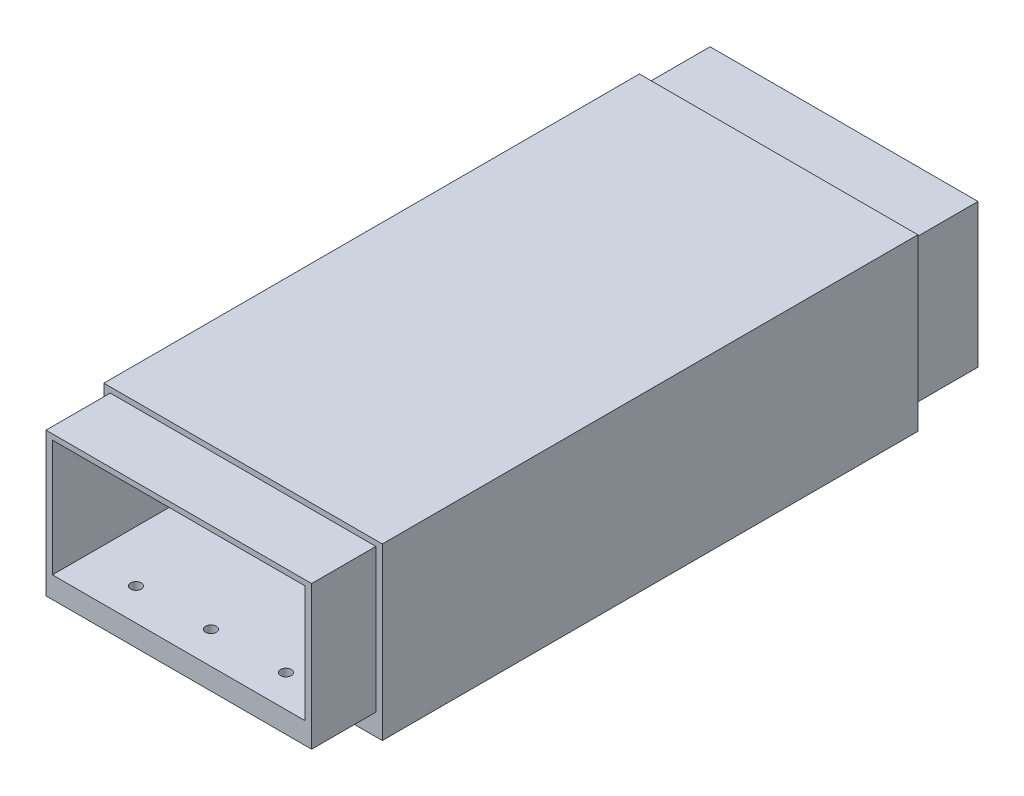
from build123d import *

# Parameters (mm, degrees)
SKETCH_1_W          = 125.075330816
SKETCH_1_H          = 66.992730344
SKETCH_1_W_2        = 118
SKETCH_1_H_2        = 54.492730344
EXTRUDE_1_DEPTH     = 30
SKETCH_2_W          = 130
SKETCH_2_H          = 79.492730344
EXTRUDE_2_DEPTH     = 250
CUT_EXTRUDE_1_REACH = 314.68
SKETCH_3_W          = 118
SKETCH_3_H          = 54.492730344
SKETCH_4_W          = 124
SKETCH_4_H          = 66.992730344
SKETCH_4_W_2        = 118
SKETCH_4_H_2        = 54.492730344
EXTRUDE_3_DEPTH     = 30
CUT_EXTRUDE_2_REACH = 1717.776
SKETCH_5_R          = 2.5
CUT_EXTRUDE_3_REACH = 1717.776
SKETCH_6_R          = 2.5


with BuildPart() as part:
    # Sketch 1 → Extrude 1 (new body)
    with BuildSketch(Plane.XY.offset(1400)):
        with Locations((-56.764728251, 106.521030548)):
            Rectangle(SKETCH_1_W, SKETCH_1_H)
        with Locations((-57.302393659, 110.271030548)):
            Rectangle(SKETCH_1_W_2, SKETCH_1_H_2, mode=Mode.SUBTRACT)
    extrude(amount=EXTRUDE_1_DEPTH)

    # Sketch 2 → Extrude 2 (add)
    with BuildSketch(Plane.XY.offset(1430)):
        with Locations((-57.302393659, 102.771030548)):
            Rectangle(SKETCH_2_W, SKETCH_2_H)
    extrude(amount=EXTRUDE_2_DEPTH)

    # Sketch 3 → Cut-Extrude 1 (cut, up to next)
    with BuildSketch(Plane(origin=(0, 0, 1430), x_dir=(-1, 0, 0), z_dir=(0, 0, -1)), mode=Mode.PRIVATE) as cut_extrude_1_sk1:
        with Locations((57.302393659, 110.271030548)):
            Rectangle(SKETCH_3_W, SKETCH_3_H)
    cut_extrude_1_tool1 = extrude(cut_extrude_1_sk1.sketch, amount=-CUT_EXTRUDE_1_REACH, mode=Mode.PRIVATE) & part.part
    add(cut_extrude_1_tool1.solids().sort_by_distance((-57.302394, 110.271031, 1430))[0], mode=Mode.SUBTRACT)

    # Sketch 4 → Extrude 3 (add)
    with BuildSketch(Plane.XY.offset(1680)):
        with Locations((-57.302393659, 106.521030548)):
            Rectangle(SKETCH_4_W, SKETCH_4_H)
        with Locations((-57.302393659, 110.271030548)):
            Rectangle(SKETCH_4_W_2, SKETCH_4_H_2, mode=Mode.SUBTRACT)
    extrude(amount=EXTRUDE_3_DEPTH)

    # Sketch 5 → Cut-Extrude 2 (cut, up to next)
    with BuildSketch(Plane.XZ.offset(-73.024665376), mode=Mode.PRIVATE) as cut_extrude_2_sk1:
        with Locations(Location((-92.302393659, 1415, 0), (0, 0, 270))):
            Circle(SKETCH_5_R)
    cut_extrude_2_tool1 = extrude(cut_extrude_2_sk1.sketch, amount=-CUT_EXTRUDE_2_REACH, mode=Mode.PRIVATE) & part.part
    # Sketch 5 → Cut-Extrude 2 (cut, up to next)
    with BuildSketch(Plane.XZ.offset(-73.024665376), mode=Mode.PRIVATE) as cut_extrude_2_sk2:
        with Locations(Location((-57.302393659, 1415, 0), (0, 0, 270))):
            Circle(SKETCH_5_R)
    cut_extrude_2_tool2 = extrude(cut_extrude_2_sk2.sketch, amount=-CUT_EXTRUDE_2_REACH, mode=Mode.PRIVATE) & part.part
    # Sketch 5 → Cut-Extrude 2 (cut, up to next)
    with BuildSketch(Plane.XZ.offset(-73.024665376), mode=Mode.PRIVATE) as cut_extrude_2_sk3:
        with Locations(Location((-22.302393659, 1415, 0), (0, 0, 270))):
            Circle(SKETCH_5_R)
    cut_extrude_2_tool3 = extrude(cut_extrude_2_sk3.sketch, amount=-CUT_EXTRUDE_2_REACH, mode=Mode.PRIVATE) & part.part
    add(cut_extrude_2_tool1.solids().sort_by_distance((-92.302394, 73.024665, 1415))[0], mode=Mode.SUBTRACT)
    add(cut_extrude_2_tool2.solids().sort_by_distance((-57.302394, 73.024665, 1415))[0], mode=Mode.SUBTRACT)
    add(cut_extrude_2_tool3.solids().sort_by_distance((-22.302394, 73.024665, 1415))[0], mode=Mode.SUBTRACT)

    # Sketch 6 → Cut-Extrude 3 (cut, up to next)
    with BuildSketch(Plane.XZ.offset(-73.024665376), mode=Mode.PRIVATE) as cut_extrude_3_sk1:
        with Locations(Location((-92.302393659, 1695, 0), (0, 0, 270))):
            Circle(SKETCH_6_R)
    cut_extrude_3_tool1 = extrude(cut_extrude_3_sk1.sketch, amount=-CUT_EXTRUDE_3_REACH, mode=Mode.PRIVATE) & part.part
    # Sketch 6 → Cut-Extrude 3 (cut, up to next)
    with BuildSketch(Plane.XZ.offset(-73.024665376), mode=Mode.PRIVATE) as cut_extrude_3_sk2:
        with Locations(Location((-57.302393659, 1695, 0), (0, 0, 270))):
            Circle(SKETCH_6_R)
    cut_extrude_3_tool2 = extrude(cut_extrude_3_sk2.sketch, amount=-CUT_EXTRUDE_3_REACH, mode=Mode.PRIVATE) & part.part
    # Sketch 6 → Cut-Extrude 3 (cut, up to next)
    with BuildSketch(Plane.XZ.offset(-73.024665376), mode=Mode.PRIVATE) as cut_extrude_3_sk3:
        with Locations(Location((-22.302393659, 1695, 0), (0, 0, 270))):
            Circle(SKETCH_6_R)
    cut_extrude_3_tool3 = extrude(cut_extrude_3_sk3.sketch, amount=-CUT_EXTRUDE_3_REACH, mode=Mode.PRIVATE) & part.part
    add(cut_extrude_3_tool1.solids().sort_by_distance((-92.302394, 73.024665, 1695))[0], mode=Mode.SUBTRACT)
    add(cut_extrude_3_tool2.solids().sort_by_distance((-57.302394, 73.024665, 1695))[0], mode=Mode.SUBTRACT)
    add(cut_extrude_3_tool3.solids().sort_by_distance((-22.302394, 73.024665, 1695))[0], mode=Mode.SUBTRACT)


solid = part.part
